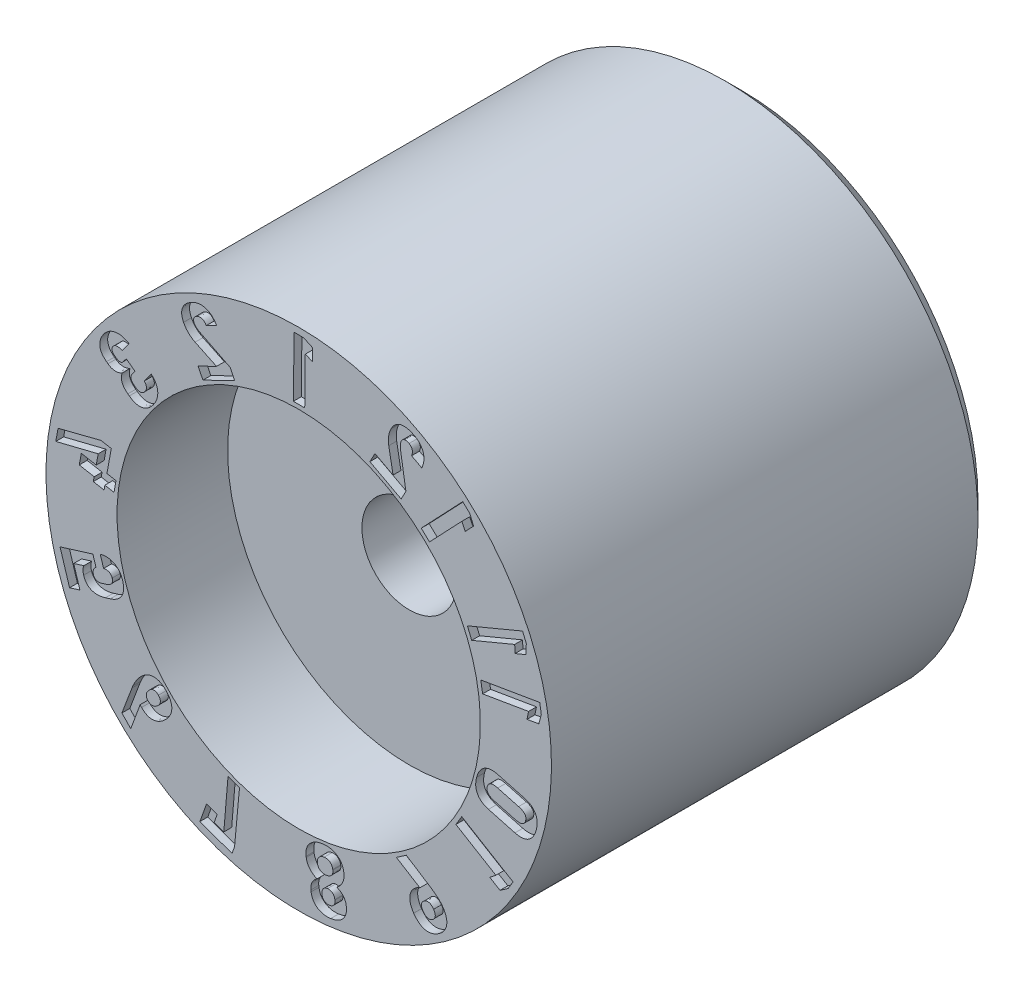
from build123d import *

# Parameters (mm, degrees)
CUT_EXTRUDE1_DEPTH = 0.25


with BuildPart() as part:
    # Sketch1 → Revolve1 (revolve)
    with BuildSketch(Plane.ZY, mode=Mode.PRIVATE) as revolve1_sk:
        Polygon((-14, -1.5), (-14, -7.5), (-13.5, -8), (0, -8), (0, -5.75), (-3.5, -5.75), (-3.5, -1.5), align=None)
    revolve(revolve1_sk.sketch.rotate(Axis((0, 0, 0), (0, 0, 1)), 180), axis=Axis((0, 0, 0), (0, 0, 1)))

    # Sketch2 → Cut-Extrude1 (cut)
    # profile 1 of 15: a face of its own
    with BuildSketch(Plane(origin=(0, 0, 0), x_dir=(0, -1, 0), z_dir=(0, 0, 1))):
        Polygon((-5.885153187, -0.168355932), (-5.881302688, 0.190394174), (-7.364876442, 0.206960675), (-7.274115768, 0.438182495), (-7.655787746, 0.442508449), (-7.787077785, 0.159422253), (-7.790397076, -0.146915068), align=None)
    # profile 2 of 15: a face of its own
    with BuildSketch(Plane(origin=(0, 0, 0), x_dir=(0, -1, 0), z_dir=(0, 0, 1))):
        with BuildLine():
            Line((-5.812942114, -2.167553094), (-6.295264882, -3.126022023))
            add(Edge.make_bspline(
                [(-6.295264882, -3.126022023), (-6.31520166, -3.166834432), (-6.346414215, -3.214181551), (-6.392438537, -3.261542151), (-6.421783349, -3.286652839), (-6.445317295, -3.302041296), (-6.461459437, -3.31016242)],
                knots=[0, 0, 0, 0, 0.540924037, 0.666718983, 0.785210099, 1, 1, 1, 1], degree=3))
            Line((-6.461459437, -3.31016242), (-6.464077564, -3.311132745))
            add(Edge.make_bspline(
                [(-6.464077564, -3.311132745), (-6.484746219, -3.321591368), (-6.517779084, -3.331425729), (-6.56228831, -3.329436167), (-6.593102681, -3.319655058), (-6.621650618, -3.302317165), (-6.659298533, -3.268966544), (-6.678882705, -3.234254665), (-6.691342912, -3.210282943)],
                knots=[0, 0, 0, 0, 0.246374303, 0.357484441, 0.468975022, 0.586096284, 0.710177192, 1, 1, 1, 1], degree=3))
            add(Edge.make_bspline(
                [(-6.691342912, -3.210282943), (-6.703164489, -3.186032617), (-6.715254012, -3.147124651), (-6.713467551, -3.093856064), (-6.702811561, -3.055802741), (-6.684911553, -3.019007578), (-6.648077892, -2.97095825), (-6.61063294, -2.942066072), (-6.583430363, -2.924510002)],
                knots=[0, 0, 0, 0, 0.239491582, 0.352314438, 0.467332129, 0.586809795, 0.712523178, 1, 1, 1, 1], degree=3))
            Line((-6.583430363, -2.924510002), (-6.582434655, -2.923797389))
            Line((-6.582434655, -2.923797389), (-6.743011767, -2.595286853))
            Line((-6.743011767, -2.595286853), (-6.744007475, -2.595999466))
            add(Edge.make_bspline(
                [(-6.744007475, -2.595999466), (-6.792261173, -2.623619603), (-6.859458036, -2.67046474), (-6.93484108, -2.74558773), (-6.980633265, -2.804634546), (-7.017421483, -2.866921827), (-7.044647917, -2.93211203), (-7.061866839, -2.99996788), (-7.06939807, -3.070051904), (-7.066888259, -3.141660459), (-7.051494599, -3.240720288), (-7.023404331, -3.312332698), (-7.001218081, -3.35902872)],
                knots=[0, 0, 0, 0, 0.185500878, 0.27133804, 0.354019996, 0.434024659, 0.511906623, 0.588797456, 0.666690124, 0.746155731, 0.827114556, 1, 1, 1, 1], degree=3))
            add(Edge.make_bspline(
                [(-7.001218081, -3.35902872), (-6.976993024, -3.408362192), (-6.936400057, -3.477857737), (-6.870052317, -3.557659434), (-6.818118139, -3.606210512), (-6.762975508, -3.645254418), (-6.705356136, -3.675823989), (-6.64412768, -3.69489597), (-6.580854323, -3.70550424), (-6.515312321, -3.705525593), (-6.423375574, -3.691574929), (-6.355871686, -3.667430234), (-6.312234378, -3.645743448)],
                knots=[0, 0, 0, 0, 0.194750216, 0.283308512, 0.36663251, 0.445697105, 0.521961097, 0.596530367, 0.671739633, 0.748345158, 0.827520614, 1, 1, 1, 1], degree=3))
            Line((-6.312234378, -3.645743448), (-6.311238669, -3.645030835))
            add(Edge.make_bspline(
                [(-6.311238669, -3.645030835), (-6.272379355, -3.62655984), (-6.217050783, -3.592404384), (-6.14845713, -3.538681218), (-6.100425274, -3.492926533), (-6.055421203, -3.444057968), (-6.002689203, -3.373963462), (-5.968114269, -3.318257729), (-5.949696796, -3.27877272)],
                knots=[0, 0, 0, 0, 0.245975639, 0.371149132, 0.498271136, 0.625429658, 0.751106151, 1, 1, 1, 1], degree=3))
            Line((-5.949696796, -3.27877272), (-5.625621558, -2.601596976))
            Line((-5.625621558, -2.601596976), (-5.341658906, -3.18329857))
            Line((-5.341658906, -3.18329857), (-5.032668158, -3.032475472))
            Line((-5.032668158, -3.032475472), (-5.52401196, -2.026569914))
            Line((-5.52401196, -2.026569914), (-5.812942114, -2.167553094))
        make_face()
    # profile 3 of 15: a face of its own
    with BuildSketch(Plane(origin=(0, 0, 0), x_dir=(0, -1, 0), z_dir=(0, 0, 1))):
        with BuildLine():
            Line((-4.376939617, -4.667268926), (-4.079887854, -4.889432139))
            add(Edge.make_bspline(
                [(-4.079887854, -4.889432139), (-4.066862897, -4.876079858), (-4.046076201, -4.858201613), (-4.015739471, -4.839389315), (-3.992796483, -4.829398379), (-3.969627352, -4.822369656), (-3.946235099, -4.818796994), (-3.922738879, -4.817817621), (-3.899154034, -4.820185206), (-3.875824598, -4.825871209), (-3.844475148, -4.838073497), (-3.822370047, -4.851262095), (-3.808438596, -4.861853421)],
                knots=[0, 0, 0, 0, 0.185321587, 0.271185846, 0.353768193, 0.433305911, 0.511128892, 0.588304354, 0.666454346, 0.745867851, 0.826198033, 1, 1, 1, 1], degree=3))
            add(Edge.make_bspline(
                [(-3.808438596, -4.861853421), (-3.783823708, -4.879930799), (-3.751641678, -4.911538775), (-3.72458046, -4.962732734), (-3.714814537, -5.002018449), (-3.713859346, -5.042510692), (-3.726562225, -5.099704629), (-3.749386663, -5.139214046), (-3.767887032, -5.164127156)],
                knots=[0, 0, 0, 0, 0.264915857, 0.382862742, 0.497043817, 0.612324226, 0.730419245, 1, 1, 1, 1], degree=3))
            Line((-3.767887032, -5.164127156), (-3.794423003, -5.199701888))
            add(Edge.make_bspline(
                [(-3.794423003, -5.199701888), (-3.814347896, -5.225103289), (-3.844811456, -5.261176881), (-3.894721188, -5.293181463), (-3.93038478, -5.308416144), (-3.966691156, -5.313923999), (-4.016197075, -5.310601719), (-4.049828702, -5.291494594), (-4.07010289, -5.276931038)],
                knots=[0, 0, 0, 0, 0.301107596, 0.428623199, 0.546089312, 0.65726331, 0.765523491, 1, 1, 1, 1], degree=3))
            Line((-4.07010289, -5.276931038), (-4.199209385, -5.180429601))
            Line((-4.199209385, -5.180429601), (-4.406597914, -5.457391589))
            Line((-4.406597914, -5.457391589), (-4.277491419, -5.553893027))
            add(Edge.make_bspline(
                [(-4.277491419, -5.553893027), (-4.260635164, -5.565909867), (-4.239461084, -5.589387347), (-4.225574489, -5.628128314), (-4.222703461, -5.659270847), (-4.2267163, -5.692307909), (-4.242889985, -5.740749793), (-4.263711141, -5.77512868), (-4.280687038, -5.79729185)],
                knots=[0, 0, 0, 0, 0.226456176, 0.333734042, 0.44465875, 0.565242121, 0.694773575, 1, 1, 1, 1], degree=3))
            Line((-4.280687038, -5.79729185), (-4.300088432, -5.823307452))
            add(Edge.make_bspline(
                [(-4.300088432, -5.823307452), (-4.316012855, -5.844002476), (-4.341474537, -5.8727942), (-4.383221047, -5.897670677), (-4.413897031, -5.908431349), (-4.445270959, -5.911701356), (-4.488564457, -5.906021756), (-4.518352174, -5.889751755), (-4.536312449, -5.876314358)],
                knots=[0, 0, 0, 0, 0.287243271, 0.411791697, 0.527494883, 0.639812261, 0.753406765, 1, 1, 1, 1], degree=3))
            add(Edge.make_bspline(
                [(-4.536312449, -5.876314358), (-4.548623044, -5.866683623), (-4.565926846, -5.850599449), (-4.582928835, -5.824364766), (-4.592820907, -5.80316774), (-4.599980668, -5.780443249), (-4.604201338, -5.756422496), (-4.605696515, -5.731072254), (-4.603721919, -5.704535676), (-4.599043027, -5.677018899), (-4.587890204, -5.638166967), (-4.576273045, -5.609270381), (-4.566471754, -5.590250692)],
                knots=[0, 0, 0, 0, 0.149750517, 0.222735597, 0.297357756, 0.372558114, 0.449624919, 0.529756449, 0.614461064, 0.703230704, 0.795895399, 1, 1, 1, 1], degree=3))
            Line((-4.566471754, -5.590250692), (-4.862435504, -5.368962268))
            add(Edge.make_bspline(
                [(-4.862435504, -5.368962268), (-4.891143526, -5.415961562), (-4.927755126, -5.488700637), (-4.957183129, -5.590589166), (-4.968838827, -5.664823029), (-4.971300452, -5.737836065), (-4.963491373, -5.808924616), (-4.946973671, -5.877593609), (-4.920574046, -5.943204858), (-4.886613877, -6.005640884), (-4.828255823, -6.083399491), (-4.774794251, -6.134163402), (-4.734803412, -6.163461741)],
                knots=[0, 0, 0, 0, 0.185347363, 0.2717601, 0.355594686, 0.437386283, 0.51661572, 0.595330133, 0.674074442, 0.753729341, 0.833596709, 1, 1, 1, 1], degree=3))
            add(Edge.make_bspline(
                [(-4.734803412, -6.163461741), (-4.702912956, -6.18745052), (-4.653871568, -6.219370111), (-4.585926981, -6.253329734), (-4.536705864, -6.272589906), (-4.487875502, -6.286144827), (-4.439468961, -6.294856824), (-4.391390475, -6.297394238), (-4.343961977, -6.295238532), (-4.297429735, -6.287633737), (-4.252425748, -6.273939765), (-4.20851339, -6.255839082), (-4.16645013, -6.231740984), (-4.125826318, -6.202455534), (-4.072028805, -6.155310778), (-4.036506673, -6.113185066), (-4.013813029, -6.083381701)],
                knots=[0, 0, 0, 0, 0.145014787, 0.212026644, 0.275758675, 0.336776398, 0.39593773, 0.454131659, 0.511359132, 0.568208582, 0.624972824, 0.681963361, 0.740474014, 0.800696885, 0.863706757, 1, 1, 1, 1], degree=3))
            Line((-4.013813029, -6.083381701), (-3.979267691, -6.037159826))
            add(Edge.make_bspline(
                [(-3.979267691, -6.037159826), (-3.954258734, -6.003922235), (-3.923173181, -5.949903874), (-3.900745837, -5.871615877), (-3.892935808, -5.8127359), (-3.894965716, -5.753416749), (-3.91096132, -5.673308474), (-3.936653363, -5.616438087), (-3.958795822, -5.580837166)],
                knots=[0, 0, 0, 0, 0.256338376, 0.378395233, 0.49923366, 0.620463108, 0.741960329, 1, 1, 1, 1], degree=3))
            add(Edge.make_bspline(
                [(-3.958795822, -5.580837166), (-3.938231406, -5.590570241), (-3.906080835, -5.601384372), (-3.862436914, -5.609970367), (-3.830187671, -5.613625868), (-3.797970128, -5.61297914), (-3.76571684, -5.609847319), (-3.733506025, -5.603287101), (-3.690475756, -5.590260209), (-3.6377408, -5.565586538), (-3.554013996, -5.509770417), (-3.502430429, -5.450637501), (-3.469850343, -5.408716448)],
                knots=[0, 0, 0, 0, 0.120783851, 0.179432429, 0.236283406, 0.292935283, 0.350395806, 0.408362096, 0.467374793, 0.589076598, 0.716315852, 1, 1, 1, 1], degree=3))
            Line((-3.469850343, -5.408716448), (-3.435305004, -5.362494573))
            add(Edge.make_bspline(
                [(-3.435305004, -5.362494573), (-3.404878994, -5.320622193), (-3.363804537, -5.256178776), (-3.330008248, -5.163323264), (-3.315460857, -5.09594918), (-3.311629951, -5.029090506), (-3.317329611, -4.963061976), (-3.334419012, -4.898255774), (-3.361512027, -4.834913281), (-3.398593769, -4.773342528), (-3.464190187, -4.69259431), (-3.52403709, -4.638839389), (-3.568330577, -4.606237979)],
                knots=[0, 0, 0, 0, 0.178322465, 0.259913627, 0.338341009, 0.414266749, 0.489149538, 0.565076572, 0.643478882, 0.72510618, 0.811155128, 1, 1, 1, 1], degree=3))
            add(Edge.make_bspline(
                [(-3.568330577, -4.606237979), (-3.611870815, -4.572683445), (-3.681516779, -4.531388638), (-3.779048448, -4.4902578), (-3.851703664, -4.470482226), (-3.92421048, -4.46013516), (-3.995914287, -4.45977701), (-4.066537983, -4.469343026), (-4.135653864, -4.488593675), (-4.202273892, -4.518347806), (-4.288368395, -4.572153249), (-4.343460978, -4.627186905), (-4.376939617, -4.667268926)],
                knots=[0, 0, 0, 0, 0.181568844, 0.266779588, 0.349602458, 0.430041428, 0.508528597, 0.586128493, 0.665194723, 0.745151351, 0.826792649, 1, 1, 1, 1], degree=3))
        make_face()
    # profile 4 of 15: a face of its own
    with BuildSketch(Plane(origin=(0, 0, 0), x_dir=(0, -1, 0), z_dir=(0, 0, 1))):
        Polygon((-1.76735733, -6.255397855), (-1.422102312, -7.616930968), (-1.024163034, -7.68967026), (-1.356596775, -6.346481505), (-1.016176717, -6.408938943), (-1.102909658, -6.881648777), (-0.751106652, -6.946096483), (-0.664391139, -6.473481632), (-0.51825503, -6.500293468), (-0.455984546, -6.161617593), (-0.602249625, -6.134799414), (-0.549444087, -5.846999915), (-0.901247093, -5.78255221), (-0.954042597, -6.070297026), (-1.707973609, -5.932061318), align=None)
    # profile 5 of 15: a face of its own
    with BuildSketch(Plane(origin=(0, 0, 0), x_dir=(0, -1, 0), z_dir=(0, 0, 1))):
        with BuildLine():
            Line((1.359546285, -6.280928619), (1.359944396, -6.282086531))
            Line((1.359944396, -6.282086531), (1.700787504, -6.176422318))
            Line((1.700787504, -6.176422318), (1.700389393, -6.175264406))
            add(Edge.make_bspline(
                [(1.700389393, -6.175264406), (1.693579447, -6.144174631), (1.689693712, -6.098094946), (1.697964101, -6.039231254), (1.711720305, -6.001184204), (1.731788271, -5.967675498), (1.768629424, -5.930397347), (1.803979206, -5.911794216), (1.829573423, -5.904389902)],
                knots=[0, 0, 0, 0, 0.286250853, 0.411970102, 0.532178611, 0.648041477, 0.760756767, 1, 1, 1, 1], degree=3))
            add(Edge.make_bspline(
                [(1.829573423, -5.904389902), (1.856561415, -5.895861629), (1.898483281, -5.889871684), (1.951960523, -5.901397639), (1.987345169, -5.919355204), (2.018894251, -5.945636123), (2.05801014, -5.993327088), (2.07622697, -6.038499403), (2.08646443, -6.070104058)],
                knots=[0, 0, 0, 0, 0.245943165, 0.357035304, 0.469046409, 0.5862071, 0.710396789, 1, 1, 1, 1], degree=3))
            Line((2.08646443, -6.070104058), (2.133351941, -6.221917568))
            add(Edge.make_bspline(
                [(2.133351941, -6.221917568), (2.143225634, -6.253640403), (2.153630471, -6.300650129), (2.151231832, -6.361526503), (2.141729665, -6.400101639), (2.125520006, -6.433924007), (2.092757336, -6.471736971), (2.058860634, -6.489686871), (2.034563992, -6.496843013)],
                knots=[0, 0, 0, 0, 0.302868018, 0.431900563, 0.550442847, 0.661671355, 0.769583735, 1, 1, 1, 1], degree=3))
            add(Edge.make_bspline(
                [(2.034563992, -6.496843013), (2.011738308, -6.503702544), (1.976667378, -6.510372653), (1.930327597, -6.50677804), (1.897834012, -6.498959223), (1.867479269, -6.48566651), (1.829851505, -6.460848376), (1.806583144, -6.435439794), (1.793961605, -6.416163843)],
                knots=[0, 0, 0, 0, 0.262338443, 0.385717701, 0.507592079, 0.627408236, 0.747450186, 1, 1, 1, 1], degree=3))
            Line((1.793961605, -6.416163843), (1.475589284, -6.514879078))
            Line((1.475589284, -6.514879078), (1.797775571, -7.55439719))
            Line((1.797775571, -7.55439719), (2.769266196, -7.253528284))
            Line((2.769266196, -7.253528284), (2.667438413, -6.925349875))
            Line((2.667438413, -6.925349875), (2.036790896, -7.120554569))
            Line((2.036790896, -7.120554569), (1.937985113, -6.800789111))
            add(Edge.make_bspline(
                [(1.937985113, -6.800789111), (1.955713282, -6.809342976), (1.984803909, -6.819486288), (2.026765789, -6.825786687), (2.061517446, -6.828033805), (2.09732674, -6.826772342), (2.14426206, -6.822854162), (2.178466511, -6.814845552), (2.200511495, -6.808155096)],
                knots=[0, 0, 0, 0, 0.220181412, 0.341690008, 0.473687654, 0.609113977, 0.742086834, 1, 1, 1, 1], degree=3))
            add(Edge.make_bspline(
                [(2.200511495, -6.808155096), (2.244247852, -6.794374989), (2.306968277, -6.767857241), (2.377960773, -6.715006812), (2.422080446, -6.669956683), (2.458624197, -6.619024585), (2.486500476, -6.561962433), (2.505749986, -6.499324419), (2.516539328, -6.431350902), (2.51858853, -6.358654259), (2.510978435, -6.251834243), (2.490949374, -6.171060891), (2.474430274, -6.116560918)],
                knots=[0, 0, 0, 0, 0.163580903, 0.239382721, 0.313637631, 0.38716286, 0.461531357, 0.538642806, 0.619556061, 0.7057246, 0.796949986, 1, 1, 1, 1], degree=3))
            Line((2.474430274, -6.116560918), (2.427542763, -5.964747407))
            add(Edge.make_bspline(
                [(2.427542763, -5.964747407), (2.410678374, -5.91030167), (2.379525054, -5.832622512), (2.321591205, -5.741248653), (2.273497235, -5.683906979), (2.220154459, -5.635664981), (2.16174598, -5.597010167), (2.09817238, -5.568523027), (2.030155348, -5.549471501), (1.957838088, -5.540601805), (1.853379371, -5.542353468), (1.77442819, -5.559292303), (1.722010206, -5.575723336)],
                knots=[0, 0, 0, 0, 0.186924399, 0.27222488, 0.353505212, 0.431383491, 0.507078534, 0.582001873, 0.658710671, 0.737652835, 0.819859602, 1, 1, 1, 1], degree=3))
            add(Edge.make_bspline(
                [(1.722010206, -5.575723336), (1.6757503, -5.590341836), (1.60883614, -5.618537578), (1.530317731, -5.672587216), (1.478742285, -5.719395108), (1.434167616, -5.772223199), (1.398045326, -5.831426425), (1.368937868, -5.895551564), (1.349138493, -5.965384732), (1.337991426, -6.03951741), (1.335095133, -6.145942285), (1.346922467, -6.226906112), (1.359546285, -6.280928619)],
                knots=[0, 0, 0, 0, 0.164951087, 0.244386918, 0.322686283, 0.400848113, 0.478265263, 0.557501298, 0.639295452, 0.72392502, 0.811482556, 1, 1, 1, 1], degree=3))
        make_face()
    # profile 6 of 15: a face of its own
    with BuildSketch(Plane(origin=(0, 0, 0), x_dir=(0, -1, 0), z_dir=(0, 0, 1))):
        with BuildLine():
            Line((4.067218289, -4.98997069), (4.068008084, -4.99072939))
            add(Edge.make_bspline(
                [(4.068008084, -4.99072939), (4.092620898, -5.016115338), (4.132644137, -5.052429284), (4.190426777, -5.097553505), (4.288009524, -5.165232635), (4.376535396, -5.212851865), (4.45033736, -5.245627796)],
                knots=[0, 0, 0, 0, 0.229425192, 0.35033143, 0.475684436, 1, 1, 1, 1], degree=3))
            add(Edge.make_bspline(
                [(4.45033736, -5.245627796), (4.463440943, -5.251114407), (4.488782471, -5.26304774), (4.515058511, -5.272766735), (4.528043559, -5.277373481)],
                knots=[0, 0, 0, 0, 0.507578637, 1, 1, 1, 1], degree=3))
            Line((4.528043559, -5.277373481), (5.373309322, -5.596946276))
            Line((5.373309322, -5.596946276), (5.663931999, -5.315754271))
            Line((5.663931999, -5.315754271), (4.854541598, -5.018208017))
            add(Edge.make_bspline(
                [(4.854541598, -5.018208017), (4.874059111, -5.005574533), (4.892156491, -4.99075352), (4.908856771, -4.974619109)],
                knots=[0.758085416, 0.758085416, 0.758085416, 0.758085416, 1, 1, 1, 1], degree=3))
            add(Edge.make_bspline(
                [(4.908856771, -4.974619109), (4.94424021, -4.940942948), (4.989834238, -4.885600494), (5.034658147, -4.803794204), (5.056175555, -4.741656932), (5.068587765, -4.678140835), (5.06967197, -4.61349998), (5.061328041, -4.548147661), (5.042543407, -4.482398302), (5.014154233, -4.416433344), (4.961717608, -4.325749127), (4.909184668, -4.263774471), (4.870927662, -4.223670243)],
                knots=[0, 0, 0, 0, 0.171552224, 0.250175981, 0.326701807, 0.401808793, 0.476742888, 0.552955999, 0.6326332, 0.716300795, 0.804840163, 1, 1, 1, 1], degree=3))
            Line((4.870927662, -4.223670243), (4.869742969, -4.222532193))
            add(Edge.make_bspline(
                [(4.869742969, -4.222532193), (4.830746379, -4.181078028), (4.767444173, -4.127074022), (4.675254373, -4.071239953), (4.606572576, -4.041902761), (4.537407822, -4.022738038), (4.467893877, -4.014734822), (4.39850819, -4.017035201), (4.329534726, -4.031363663), (4.261448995, -4.055770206), (4.169377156, -4.1042583), (4.10692275, -4.154944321), (4.067479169, -4.19294318)],
                knots=[0, 0, 0, 0, 0.186949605, 0.27196259, 0.353438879, 0.431722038, 0.507097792, 0.582641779, 0.658968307, 0.737737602, 0.819719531, 1, 1, 1, 1], degree=3))
            add(Edge.make_bspline(
                [(4.067479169, -4.19294318), (4.028364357, -4.230837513), (3.976043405, -4.291257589), (3.924047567, -4.380877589), (3.897374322, -4.447999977), (3.880913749, -4.516142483), (3.875694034, -4.585011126), (3.881083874, -4.654094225), (3.896997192, -4.723355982), (3.92395464, -4.792059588), (3.975706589, -4.885467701), (4.027778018, -4.949636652), (4.067218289, -4.98997069)],
                knots=[0, 0, 0, 0, 0.180435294, 0.262660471, 0.34194499, 0.418744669, 0.493877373, 0.569633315, 0.647321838, 0.728297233, 0.813160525, 1, 1, 1, 1], degree=3))
        make_face()
        with BuildLine():
            Line((4.597125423, -4.455339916), (4.598310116, -4.456477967))
            add(Edge.make_bspline(
                [(4.598310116, -4.456477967), (4.622350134, -4.481584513), (4.654454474, -4.520775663), (4.679315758, -4.579804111), (4.6879526, -4.621140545), (4.686927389, -4.66165505), (4.672045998, -4.715332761), (4.645542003, -4.749564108), (4.6251244, -4.769636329)],
                knots=[0, 0, 0, 0, 0.294172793, 0.419084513, 0.536108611, 0.647083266, 0.757101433, 1, 1, 1, 1], degree=3))
            add(Edge.make_bspline(
                [(4.6251244, -4.769636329), (4.604705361, -4.789103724), (4.569653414, -4.814154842), (4.515518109, -4.82644603), (4.474628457, -4.8260993), (4.433355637, -4.815479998), (4.375334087, -4.788184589), (4.337405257, -4.754694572), (4.312959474, -4.730205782)],
                knots=[0, 0, 0, 0, 0.239606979, 0.350713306, 0.462757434, 0.580918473, 0.706867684, 1, 1, 1, 1], degree=3))
            Line((4.312959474, -4.730205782), (4.312169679, -4.729447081))
            add(Edge.make_bspline(
                [(4.312169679, -4.729447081), (4.291646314, -4.707328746), (4.263538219, -4.672645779), (4.244101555, -4.619425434), (4.238684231, -4.581286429), (4.24282821, -4.543523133), (4.260608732, -4.492826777), (4.286847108, -4.460096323), (4.307144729, -4.440637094)],
                knots=[0, 0, 0, 0, 0.277690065, 0.398448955, 0.513505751, 0.626362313, 0.741961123, 1, 1, 1, 1], degree=3))
            add(Edge.make_bspline(
                [(4.307144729, -4.440637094), (4.327308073, -4.420334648), (4.361550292, -4.395798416), (4.413213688, -4.37923391), (4.451301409, -4.377076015), (4.489474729, -4.383566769), (4.542139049, -4.404676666), (4.575984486, -4.433825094), (4.597125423, -4.455339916)],
                knots=[0, 0, 0, 0, 0.260088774, 0.374782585, 0.488633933, 0.603177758, 0.72405985, 1, 1, 1, 1], degree=3))
        make_face(mode=Mode.SUBTRACT)
    # profile 7 of 15: a face of its own
    with BuildSketch(Plane(origin=(0, 0, 0), x_dir=(0, -1, 0), z_dir=(0, 0, 1))):
        Polygon((7.256514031, -2.031017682), (5.555129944, -1.873512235), (5.425210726, -2.237507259), (7.021597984, -2.371100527), (6.912220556, -2.677137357), (6.643941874, -2.581126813), (6.524146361, -2.916995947), (7.116019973, -3.128575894), (7.479650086, -2.110630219), align=None)
    # profile 8 of 15: a face of its own
    with BuildSketch(Plane(origin=(0, 0, 0), x_dir=(0, -1, 0), z_dir=(0, 0, 1))):
        with BuildLine():
            Line((6.383722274, 0.233674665), (6.414607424, 0.237614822))
            add(Edge.make_bspline(
                [(6.414607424, 0.237614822), (6.460996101, 0.242938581), (6.528596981, 0.263144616), (6.612468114, 0.30638441), (6.670550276, 0.348781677), (6.723236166, 0.397912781), (6.782117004, 0.472985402), (6.814999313, 0.536576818), (6.829495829, 0.581878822)],
                knots=[0, 0, 0, 0, 0.245873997, 0.369722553, 0.497260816, 0.624850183, 0.749381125, 1, 1, 1, 1], degree=3))
            add(Edge.make_bspline(
                [(6.829495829, 0.581878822), (6.851631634, 0.547950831), (6.891687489, 0.502065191), (6.955634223, 0.452881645), (7.007563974, 0.42284188), (7.06212033, 0.399847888), (7.136898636, 0.381524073), (7.194331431, 0.379417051), (7.23190499, 0.38501631)],
                knots=[0, 0, 0, 0, 0.257462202, 0.383888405, 0.51183656, 0.638238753, 0.759243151, 1, 1, 1, 1], degree=3))
            Line((7.23190499, 0.38501631), (7.281173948, 0.391272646))
            add(Edge.make_bspline(
                [(7.281173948, 0.391272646), (7.3279114, 0.396991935), (7.395492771, 0.414718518), (7.477774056, 0.455081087), (7.532214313, 0.493211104), (7.580046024, 0.538823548), (7.621266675, 0.590742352), (7.654444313, 0.649402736), (7.680561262, 0.713548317), (7.698886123, 0.782773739), (7.711498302, 0.883642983), (7.708804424, 0.961646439), (7.70150325, 1.014187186)],
                knots=[0, 0, 0, 0, 0.166920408, 0.24562204, 0.324151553, 0.401797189, 0.479414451, 0.5585348, 0.640110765, 0.724597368, 0.811872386, 1, 1, 1, 1], degree=3))
            add(Edge.make_bspline(
                [(7.70150325, 1.014187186), (7.693982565, 1.066446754), (7.678040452, 1.142992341), (7.63838367, 1.236532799), (7.603474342, 1.299088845), (7.561210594, 1.354025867), (7.514143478, 1.401908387), (7.461028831, 1.441255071), (7.403152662, 1.47274805), (7.340490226, 1.495108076), (7.25080929, 1.514088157), (7.180691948, 1.512435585), (7.134208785, 1.506358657)],
                knots=[0, 0, 0, 0, 0.187940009, 0.275344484, 0.360030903, 0.44165333, 0.520785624, 0.597734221, 0.675551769, 0.753950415, 0.833210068, 1, 1, 1, 1], degree=3))
            Line((7.134208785, 1.506358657), (7.084939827, 1.500102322))
            add(Edge.make_bspline(
                [(7.084939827, 1.500102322), (7.046799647, 1.495311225), (6.991084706, 1.478546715), (6.923065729, 1.440759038), (6.876602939, 1.403538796), (6.833946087, 1.360937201), (6.786089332, 1.295339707), (6.759581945, 1.240174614), (6.747764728, 1.201072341)],
                knots=[0, 0, 0, 0, 0.242029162, 0.363319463, 0.48911611, 0.616671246, 0.742842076, 1, 1, 1, 1], degree=3))
            add(Edge.make_bspline(
                [(6.747764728, 1.201072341), (6.720636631, 1.240396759), (6.673875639, 1.295883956), (6.595965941, 1.352162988), (6.532925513, 1.387357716), (6.465677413, 1.413079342), (6.374083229, 1.435794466), (6.303189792, 1.435441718), (6.257179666, 1.429918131)],
                knots=[0, 0, 0, 0, 0.252401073, 0.377133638, 0.504621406, 0.631738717, 0.755354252, 1, 1, 1, 1], degree=3))
            Line((6.257179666, 1.429918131), (6.226294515, 1.425977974))
            add(Edge.make_bspline(
                [(6.226294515, 1.425977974), (6.17677854, 1.419639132), (6.104992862, 1.401021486), (6.017674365, 1.358132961), (5.960475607, 1.317055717), (5.909395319, 1.269174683), (5.866513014, 1.213551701), (5.831051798, 1.151244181), (5.804115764, 1.08245928), (5.784892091, 1.008337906), (5.770768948, 0.900490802), (5.775355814, 0.816966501), (5.782272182, 0.760745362)],
                knots=[0, 0, 0, 0, 0.1662813, 0.245020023, 0.322996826, 0.400171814, 0.477620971, 0.556199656, 0.638392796, 0.723135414, 0.810891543, 1, 1, 1, 1], degree=3))
            add(Edge.make_bspline(
                [(5.782272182, 0.760745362), (5.789389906, 0.704510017), (5.807671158, 0.623006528), (5.849105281, 0.522447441), (5.886549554, 0.455691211), (5.930509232, 0.396348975), (5.980886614, 0.345493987), (6.036852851, 0.302844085), (6.098563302, 0.269491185), (6.164593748, 0.244892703), (6.259973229, 0.225874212), (6.334222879, 0.227215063), (6.383722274, 0.233674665)],
                knots=[0, 0, 0, 0, 0.188969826, 0.276571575, 0.361700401, 0.443462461, 0.52195862, 0.599529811, 0.677129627, 0.754933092, 0.833532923, 1, 1, 1, 1], degree=3))
        make_face()
        with BuildLine():
            Line((6.324801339, 1.078128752), (6.342697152, 1.080693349))
            add(Edge.make_bspline(
                [(6.342697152, 1.080693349), (6.36279953, 1.08399806), (6.39291409, 1.083408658), (6.43173524, 1.075943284), (6.458349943, 1.065421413), (6.483381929, 1.052126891), (6.505687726, 1.034434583), (6.526485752, 1.014233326), (6.544289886, 0.990161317), (6.559509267, 0.963254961), (6.576683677, 0.922775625), (6.583555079, 0.889629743), (6.586905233, 0.866973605)],
                knots=[0, 0, 0, 0, 0.16669051, 0.246112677, 0.323892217, 0.40126476, 0.478432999, 0.55727091, 0.639208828, 0.723761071, 0.811152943, 1, 1, 1, 1], degree=3))
            add(Edge.make_bspline(
                [(6.586905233, 0.866973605), (6.589820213, 0.844318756), (6.591437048, 0.810517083), (6.585669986, 0.766916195), (6.577904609, 0.73681742), (6.566517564, 0.709134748), (6.552212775, 0.683735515), (6.534443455, 0.661098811), (6.513582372, 0.641310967), (6.489996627, 0.624523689), (6.454436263, 0.60708053), (6.425316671, 0.599314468), (6.405202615, 0.596942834)],
                knots=[0, 0, 0, 0, 0.187429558, 0.275451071, 0.359683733, 0.441509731, 0.520154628, 0.597919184, 0.676478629, 0.755123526, 0.834279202, 1, 1, 1, 1], degree=3))
            Line((6.405202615, 0.596942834), (6.385594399, 0.594635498))
            add(Edge.make_bspline(
                [(6.385594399, 0.594635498), (6.363963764, 0.591054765), (6.331752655, 0.591449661), (6.289987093, 0.598124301), (6.261086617, 0.608048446), (6.234247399, 0.621866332), (6.209373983, 0.638570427), (6.187452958, 0.65926777), (6.168246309, 0.683157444), (6.152297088, 0.710346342), (6.133980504, 0.750396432), (6.126937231, 0.783490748), (6.123858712, 0.805910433)],
                knots=[0, 0, 0, 0, 0.17286694, 0.25386239, 0.334267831, 0.413835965, 0.492611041, 0.570906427, 0.651843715, 0.734729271, 0.820133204, 1, 1, 1, 1], degree=3))
            add(Edge.make_bspline(
                [(6.123858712, 0.805910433), (6.120503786, 0.828410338), (6.120076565, 0.862081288), (6.12689421, 0.905593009), (6.135877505, 0.935826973), (6.14813579, 0.964121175), (6.164666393, 0.989539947), (6.184347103, 1.01238777), (6.207225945, 1.032549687), (6.233065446, 1.049291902), (6.271257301, 1.068285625), (6.303243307, 1.074904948), (6.324801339, 1.078128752)],
                knots=[0, 0, 0, 0, 0.179137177, 0.263849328, 0.346610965, 0.427374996, 0.50626182, 0.584852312, 0.66468001, 0.74595602, 0.827180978, 1, 1, 1, 1], degree=3))
        make_face(mode=Mode.SUBTRACT)
        with BuildLine():
            Line((7.117138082, 1.143303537), (7.135402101, 1.145987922))
            add(Edge.make_bspline(
                [(7.135402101, 1.145987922), (7.154120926, 1.148094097), (7.182267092, 1.149667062), (7.218110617, 1.142370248), (7.243037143, 1.13496047), (7.266021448, 1.123754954), (7.286968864, 1.109795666), (7.305699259, 1.092634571), (7.322335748, 1.072919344), (7.336242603, 1.050268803), (7.35098947, 1.016059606), (7.357950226, 0.988347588), (7.360284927, 0.969141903)],
                knots=[0, 0, 0, 0, 0.176372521, 0.258700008, 0.339762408, 0.417993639, 0.495919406, 0.573463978, 0.65383693, 0.735485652, 0.820064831, 1, 1, 1, 1], degree=3))
            add(Edge.make_bspline(
                [(7.360284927, 0.969141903), (7.362978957, 0.950000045), (7.363588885, 0.921401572), (7.358067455, 0.884462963), (7.35027571, 0.859038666), (7.339687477, 0.835358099), (7.325501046, 0.814086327), (7.309072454, 0.794584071), (7.289198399, 0.778026), (7.267116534, 0.763892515), (7.233599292, 0.748723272), (7.206452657, 0.741499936), (7.187444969, 0.739454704)],
                knots=[0, 0, 0, 0, 0.178886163, 0.263391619, 0.345004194, 0.424566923, 0.502824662, 0.581173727, 0.660014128, 0.741521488, 0.823405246, 1, 1, 1, 1], degree=3))
            Line((7.187444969, 0.739454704), (7.16820496, 0.737267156))
            add(Edge.make_bspline(
                [(7.16820496, 0.737267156), (7.148534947, 0.734362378), (7.119301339, 0.733925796), (7.081399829, 0.739253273), (7.055275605, 0.747154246), (7.030776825, 0.758036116), (7.008252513, 0.77179522), (6.988359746, 0.788915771), (6.970770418, 0.808607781), (6.956208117, 0.831216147), (6.940161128, 0.865221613), (6.933093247, 0.893164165), (6.930820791, 0.912489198)],
                knots=[0, 0, 0, 0, 0.179228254, 0.262659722, 0.344810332, 0.424891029, 0.504315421, 0.582306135, 0.661155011, 0.742046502, 0.82433766, 1, 1, 1, 1], degree=3))
            add(Edge.make_bspline(
                [(6.930820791, 0.912489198), (6.928078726, 0.931649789), (6.927410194, 0.960384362), (6.934261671, 0.997235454), (6.943053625, 1.022542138), (6.954113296, 1.046532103), (6.969737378, 1.067647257), (6.987380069, 1.08733068), (7.008927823, 1.103707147), (7.032255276, 1.118544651), (7.068200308, 1.133670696), (7.096928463, 1.141218), (7.117138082, 1.143303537)],
                knots=[0, 0, 0, 0, 0.173858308, 0.255853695, 0.3354019, 0.414134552, 0.492060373, 0.570450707, 0.650797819, 0.734328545, 0.818212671, 1, 1, 1, 1], degree=3))
        make_face(mode=Mode.SUBTRACT)
    # profile 9 of 15: a face of its own
    with BuildSketch(Plane(origin=(0, 0, 0), x_dir=(0, -1, 0), z_dir=(0, 0, 1))):
        with BuildLine():
            Line((6.24184659, 3.638700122), (6.243307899, 3.639450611))
            add(Edge.make_bspline(
                [(6.243307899, 3.639450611), (6.290749, 3.671901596), (6.355592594, 3.725752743), (6.426494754, 3.808372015), (6.467578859, 3.871479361), (6.497668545, 3.937037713), (6.517592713, 4.004582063), (6.526161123, 4.073956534), (6.524349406, 4.144842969), (6.511046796, 4.216643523), (6.477962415, 4.316076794), (6.437907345, 4.386506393), (6.406914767, 4.432007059)],
                knots=[0, 0, 0, 0, 0.187469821, 0.273143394, 0.354214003, 0.43221498, 0.507589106, 0.582962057, 0.6592416, 0.7379537, 0.820209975, 1, 1, 1, 1], degree=3))
            add(Edge.make_bspline(
                [(6.406914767, 4.432007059), (6.376508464, 4.477809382), (6.323550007, 4.538225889), (6.243078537, 4.604789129), (6.179900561, 4.641520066), (6.11416663, 4.66896351), (6.045520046, 4.684359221), (5.974934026, 4.69054322), (5.902323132, 4.684642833), (5.828208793, 4.668878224), (5.724996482, 4.631513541), (5.651568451, 4.589011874), (5.603762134, 4.556315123)],
                knots=[0, 0, 0, 0, 0.178234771, 0.259637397, 0.338301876, 0.414869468, 0.490216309, 0.566018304, 0.644300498, 0.726036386, 0.81161072, 1, 1, 1, 1], degree=3))
            Line((5.603762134, 4.556315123), (5.602300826, 4.555564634))
            add(Edge.make_bspline(
                [(5.602300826, 4.555564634), (5.575139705, 4.536248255), (5.534893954, 4.504609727), (5.484919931, 4.456093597), (5.446905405, 4.415188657), (5.409108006, 4.370338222), (5.356771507, 4.304329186), (5.319021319, 4.251777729), (5.294091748, 4.215372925)],
                knots=[0, 0, 0, 0, 0.216736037, 0.331977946, 0.452460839, 0.579604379, 0.71315568, 1, 1, 1, 1], degree=3))
            add(Edge.make_bspline(
                [(5.294091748, 4.215372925), (5.286972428, 4.204409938), (5.27178557, 4.183416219), (5.257615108, 4.161717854), (5.25095223, 4.150742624)],
                knots=[0, 0, 0, 0, 0.504424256, 1, 1, 1, 1], degree=3))
            Line((5.25095223, 4.150742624), (4.77128473, 3.404855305))
            Line((4.77128473, 3.404855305), (4.987367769, 3.091387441))
            Line((4.987367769, 3.091387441), (5.448228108, 3.835268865))
            add(Edge.make_bspline(
                [(5.448228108, 3.835268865), (5.448794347, 3.833422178), (5.453279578, 3.819230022), (5.468888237, 3.778838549), (5.490240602, 3.74319131), (5.506141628, 3.719776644)],
                knots=[0.562907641, 0.562907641, 0.562907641, 0.562907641, 0.582426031, 0.71330413, 1, 1, 1, 1], degree=3))
            add(Edge.make_bspline(
                [(5.506141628, 3.719776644), (5.532177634, 3.682306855), (5.576957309, 3.63092644), (5.649313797, 3.578526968), (5.70720601, 3.549055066), (5.768408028, 3.528123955), (5.832421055, 3.516112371), (5.898955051, 3.513936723), (5.967362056, 3.52050552), (6.036741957, 3.536212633), (6.131635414, 3.570198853), (6.198442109, 3.609360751), (6.24184659, 3.638700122)],
                knots=[0, 0, 0, 0, 0.164733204, 0.243043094, 0.320867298, 0.398148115, 0.475570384, 0.554853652, 0.637425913, 0.722764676, 0.810743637, 1, 1, 1, 1], degree=3))
        make_face()
        with BuildLine():
            Line((5.820791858, 4.268572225), (5.821884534, 4.269441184))
            add(Edge.make_bspline(
                [(5.821884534, 4.269441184), (5.848164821, 4.287921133), (5.889585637, 4.309578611), (5.947724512, 4.322884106), (5.988000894, 4.322463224), (6.025968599, 4.313237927), (6.074465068, 4.288242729), (6.103175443, 4.257113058), (6.119091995, 4.233711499)],
                knots=[0, 0, 0, 0, 0.2836562, 0.407176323, 0.522864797, 0.635948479, 0.749089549, 1, 1, 1, 1], degree=3))
            add(Edge.make_bspline(
                [(6.119091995, 4.233711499), (6.135714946, 4.210027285), (6.154554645, 4.17148358), (6.161193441, 4.116606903), (6.155904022, 4.077524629), (6.141610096, 4.03972044), (6.108526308, 3.989849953), (6.073409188, 3.95886892), (6.046578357, 3.941004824)],
                knots=[0, 0, 0, 0, 0.25396243, 0.366761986, 0.479368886, 0.595910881, 0.717631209, 1, 1, 1, 1], degree=3))
            Line((6.046578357, 3.941004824), (6.045485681, 3.940135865))
            add(Edge.make_bspline(
                [(6.045485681, 3.940135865), (6.017734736, 3.922321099), (5.976032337, 3.897173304), (5.915887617, 3.884511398), (5.874761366, 3.883605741), (5.835724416, 3.892415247), (5.785948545, 3.917215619), (5.756558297, 3.948902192), (5.740352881, 3.97271868)],
                knots=[0, 0, 0, 0, 0.286687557, 0.409653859, 0.525636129, 0.638334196, 0.750719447, 1, 1, 1, 1], degree=3))
            add(Edge.make_bspline(
                [(5.740352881, 3.97271868), (5.724322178, 3.996031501), (5.705315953, 4.034328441), (5.700533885, 4.089235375), (5.706668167, 4.128689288), (5.722277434, 4.166856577), (5.755654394, 4.218747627), (5.794033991, 4.24909324), (5.820791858, 4.268572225)],
                knots=[0, 0, 0, 0, 0.245772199, 0.358139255, 0.470980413, 0.587123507, 0.711724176, 1, 1, 1, 1], degree=3))
        make_face(mode=Mode.SUBTRACT)
    # profile 10 of 15: a face of its own
    with BuildSketch(Plane(origin=(0, 0, 0), x_dir=(0, -1, 0), z_dir=(0, 0, 1))):
        Polygon((2.835416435, 5.159749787), (3.141680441, 4.975597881), (3.902263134, 6.239790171), (4.054716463, 6.045817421), (4.250124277, 6.37098681), (4.073807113, 6.626027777), (3.812451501, 6.78333898), align=None)
    # profile 11 of 15: a face of its own
    with BuildSketch(Plane(origin=(0, 0, 0), x_dir=(0, -1, 0), z_dir=(0, 0, 1))):
        with BuildLine():
            Line((2.212407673, 6.006400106), (2.43863833, 6.843654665))
            add(Edge.make_bspline(
                [(2.43863833, 6.843654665), (2.44910096, 6.88283367), (2.460420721, 6.941296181), (2.466160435, 7.018686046), (2.463910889, 7.073096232), (2.456526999, 7.125152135), (2.444274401, 7.175020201), (2.425992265, 7.222505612), (2.402714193, 7.267779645), (2.373738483, 7.310039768), (2.339897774, 7.34946275), (2.301048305, 7.385715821), (2.256309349, 7.417875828), (2.207155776, 7.447750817), (2.132103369, 7.483467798), (2.071556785, 7.504266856), (2.029297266, 7.515493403)],
                knots=[0, 0, 0, 0, 0.135733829, 0.198831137, 0.259399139, 0.31767141, 0.37462448, 0.430931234, 0.487646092, 0.544689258, 0.602065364, 0.661305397, 0.722119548, 0.786221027, 0.853655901, 1, 1, 1, 1], degree=3))
            add(Edge.make_bspline(
                [(2.029297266, 7.515493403), (1.986944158, 7.527014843), (1.924060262, 7.540223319), (1.841089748, 7.547123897), (1.783511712, 7.546692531), (1.728735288, 7.540905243), (1.676916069, 7.529327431), (1.627572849, 7.51342455), (1.581622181, 7.490916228), (1.538841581, 7.463621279), (1.499107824, 7.431904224), (1.46315664, 7.395121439), (1.430927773, 7.353390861), (1.402022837, 7.307161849), (1.36684366, 7.23765256), (1.347852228, 7.180816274), (1.33691724, 7.141546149)],
                knots=[0, 0, 0, 0, 0.146794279, 0.214109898, 0.27799967, 0.339036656, 0.397877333, 0.455243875, 0.511944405, 0.568412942, 0.624625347, 0.681540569, 0.739936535, 0.800569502, 0.863571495, 1, 1, 1, 1], degree=3))
            Line((1.33691724, 7.141546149), (1.110686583, 6.30429159))
            add(Edge.make_bspline(
                [(1.110686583, 6.30429159), (1.100223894, 6.265112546), (1.088904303, 6.206650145), (1.083164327, 6.129260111), (1.085414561, 6.074850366), (1.092796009, 6.0227929), (1.105057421, 5.972930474), (1.123307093, 5.925424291), (1.146735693, 5.880173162), (1.175295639, 5.837572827), (1.209147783, 5.79806256), (1.248570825, 5.762302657), (1.292856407, 5.729576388), (1.342138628, 5.699844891), (1.416982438, 5.663957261), (1.477910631, 5.644074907), (1.520027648, 5.632452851)],
                knots=[0, 0, 0, 0, 0.135706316, 0.198790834, 0.259346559, 0.317607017, 0.374548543, 0.430843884, 0.487547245, 0.544786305, 0.602150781, 0.66126366, 0.722560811, 0.786218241, 0.853639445, 1, 1, 1, 1], degree=3))
            add(Edge.make_bspline(
                [(1.520027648, 5.632452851), (1.562359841, 5.620480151), (1.625424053, 5.608331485), (1.708471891, 5.600994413), (1.76610086, 5.602099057), (1.82094885, 5.607568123), (1.872752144, 5.619783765), (1.921906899, 5.636753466), (1.968092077, 5.659429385), (2.010938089, 5.686957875), (2.050535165, 5.719138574), (2.086300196, 5.756026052), (2.118944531, 5.797282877), (2.14806678, 5.842843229), (2.182490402, 5.911718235), (2.202228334, 5.96740033), (2.212407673, 6.006400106)],
                knots=[0, 0, 0, 0, 0.147190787, 0.214626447, 0.278832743, 0.339978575, 0.398870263, 0.456661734, 0.513809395, 0.570752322, 0.626890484, 0.684320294, 0.742477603, 0.802826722, 0.865076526, 1, 1, 1, 1], degree=3))
        make_face()
        with BuildLine():
            Line((1.481739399, 6.299271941), (1.660182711, 6.959061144))
            add(Edge.make_bspline(
                [(1.660182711, 6.959061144), (1.671147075, 6.99868426), (1.690817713, 7.05438125), (1.730430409, 7.117314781), (1.758029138, 7.146998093), (1.782291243, 7.165076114), (1.801209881, 7.175928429), (1.821662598, 7.1834617), (1.842995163, 7.188584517), (1.865473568, 7.191136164), (1.897833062, 7.190632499), (1.922390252, 7.18597057), (1.938815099, 7.181457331)],
                knots=[0, 0, 0, 0, 0.304408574, 0.431797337, 0.547028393, 0.601171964, 0.654843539, 0.707489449, 0.761565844, 0.816558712, 0.874111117, 1, 1, 1, 1], degree=3))
            add(Edge.make_bspline(
                [(1.938815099, 7.181457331), (1.955054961, 7.1765368), (1.978982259, 7.169010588), (2.006906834, 7.15245555), (2.025335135, 7.139319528), (2.041330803, 7.124137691), (2.054461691, 7.106924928), (2.066230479, 7.088526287), (2.077531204, 7.060277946), (2.086863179, 7.020742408), (2.089417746, 6.946267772), (2.079300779, 6.888127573), (2.067929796, 6.848497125)],
                knots=[0, 0, 0, 0, 0.125752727, 0.182944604, 0.238821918, 0.292439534, 0.344834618, 0.39822355, 0.4529537, 0.568398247, 0.695928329, 1, 1, 1, 1], degree=3))
            Line((2.067929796, 6.848497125), (1.889486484, 6.188707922))
            add(Edge.make_bspline(
                [(1.889486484, 6.188707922), (1.87833576, 6.149188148), (1.859201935, 6.093324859), (1.818977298, 6.030821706), (1.79112798, 6.001520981), (1.766870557, 5.983392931), (1.747952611, 5.97251305), (1.72756471, 5.965141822), (1.706336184, 5.95950207), (1.683776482, 5.957442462), (1.651336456, 5.957751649), (1.626761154, 5.962542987), (1.610342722, 5.967010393)],
                knots=[0, 0, 0, 0, 0.30456185, 0.431162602, 0.546723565, 0.600894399, 0.654592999, 0.707265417, 0.760649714, 0.816466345, 0.874047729, 1, 1, 1, 1], degree=3))
            add(Edge.make_bspline(
                [(1.610342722, 5.967010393), (1.594098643, 5.97192377), (1.570183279, 5.97947023), (1.542350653, 5.995929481), (1.524064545, 6.009058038), (1.508151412, 6.024281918), (1.49472105, 6.041283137), (1.483291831, 6.059910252), (1.472013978, 6.087903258), (1.462263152, 6.127217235), (1.46070852, 6.2015958), (1.470101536, 6.259623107), (1.481739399, 6.299271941)],
                knots=[0, 0, 0, 0, 0.126014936, 0.183326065, 0.238377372, 0.292106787, 0.345479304, 0.39816533, 0.453009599, 0.56797277, 0.695294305, 1, 1, 1, 1], degree=3))
        make_face(mode=Mode.SUBTRACT)
    # profile 12 of 15: a face of its own
    with BuildSketch(Plane(origin=(0, 0, 0), x_dir=(0, -1, 0), z_dir=(0, 0, 1))):
        Polygon((-1.211502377, 5.761341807), (-0.859484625, 5.821176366), (-1.10584996, 7.274061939), (-0.86439821, 7.226783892), (-0.927844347, 7.599913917), (-1.227850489, 7.678888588), (-1.528162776, 7.627643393), align=None)
    # profile 13 of 15: a face of its own
    with BuildSketch(Plane(origin=(0, 0, 0), x_dir=(0, -1, 0), z_dir=(0, 0, 1))):
        Polygon((-2.483347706, 5.33832116), (-2.154422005, 5.476015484), (-2.722935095, 6.836471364), (-2.476306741, 6.84477118), (-2.622627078, 7.194304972), (-2.932801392, 7.203085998), (-3.213823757, 7.085508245), align=None)
    # profile 14 of 15: a face of its own
    with BuildSketch(Plane(origin=(0, 0, 0), x_dir=(0, -1, 0), z_dir=(0, 0, 1))):
        Polygon((-4.430620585, 3.87782594), (-4.182931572, 4.138837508), (-5.260687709, 5.162177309), (-5.036906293, 5.270536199), (-5.31411265, 5.533398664), (-5.603568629, 5.415029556), (-5.815107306, 5.192245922), align=None)
    # profile 15 of 15: a face of its own
    with BuildSketch(Plane(origin=(0, 0, 0), x_dir=(0, -1, 0), z_dir=(0, 0, 1))):
        with BuildLine():
            Line((-5.196551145, 3.392641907), (-6.257309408, 3.220825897))
            add(Edge.make_bspline(
                [(-6.257309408, 3.220825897), (-6.302163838, 3.213750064), (-6.358957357, 3.210151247), (-6.424216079, 3.220025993), (-6.461945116, 3.228655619), (-6.488218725, 3.239204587), (-6.50451492, 3.247465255)],
                knots=[0, 0, 0, 0, 0.541086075, 0.665754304, 0.782974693, 1, 1, 1, 1], degree=3))
            Line((-6.50451492, 3.247465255), (-6.506797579, 3.248704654))
            add(Edge.make_bspline(
                [(-6.506797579, 3.248704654), (-6.527135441, 3.259583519), (-6.554829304, 3.28030551), (-6.579353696, 3.317677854), (-6.589450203, 3.34847618), (-6.592309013, 3.381694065), (-6.586774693, 3.431567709), (-6.571669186, 3.468157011), (-6.558702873, 3.49205546)],
                knots=[0, 0, 0, 0, 0.245873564, 0.358403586, 0.469926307, 0.586616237, 0.710080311, 1, 1, 1, 1], degree=3))
            add(Edge.make_bspline(
                [(-6.558702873, 3.49205546), (-6.545857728, 3.516090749), (-6.521333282, 3.549001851), (-6.476888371, 3.578758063), (-6.440058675, 3.592881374), (-6.399509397, 3.599244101), (-6.338949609, 3.598130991), (-6.293324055, 3.584749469), (-6.26323756, 3.572806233)],
                knots=[0, 0, 0, 0, 0.241468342, 0.353131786, 0.468071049, 0.586792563, 0.713262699, 1, 1, 1, 1], degree=3))
            Line((-6.26323756, 3.572806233), (-6.262254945, 3.572075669))
            Line((-6.262254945, 3.572075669), (-6.089782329, 3.895169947))
            Line((-6.089782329, 3.895169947), (-6.090764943, 3.895900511))
            add(Edge.make_bspline(
                [(-6.090764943, 3.895900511), (-6.141625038, 3.918870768), (-6.219172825, 3.946146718), (-6.324637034, 3.963418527), (-6.399545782, 3.965471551), (-6.471753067, 3.958552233), (-6.540672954, 3.942490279), (-6.605917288, 3.91646581), (-6.667040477, 3.881255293), (-6.723602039, 3.837222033), (-6.794472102, 3.766386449), (-6.836585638, 3.702080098), (-6.860996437, 3.656386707)],
                knots=[0, 0, 0, 0, 0.185825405, 0.271798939, 0.354705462, 0.434521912, 0.512614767, 0.589405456, 0.667459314, 0.746593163, 0.827316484, 1, 1, 1, 1], degree=3))
            add(Edge.make_bspline(
                [(-6.860996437, 3.656386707), (-6.887061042, 3.607947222), (-6.919298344, 3.534186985), (-6.944826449, 3.433482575), (-6.954103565, 3.362766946), (-6.953421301, 3.29484405), (-6.94324037, 3.230315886), (-6.924273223, 3.16901818), (-6.894875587, 3.111812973), (-6.856778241, 3.058482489), (-6.791423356, 2.992152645), (-6.732068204, 2.95192029), (-6.688909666, 2.929267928)],
                knots=[0, 0, 0, 0, 0.194591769, 0.282898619, 0.366579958, 0.446068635, 0.52219696, 0.596816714, 0.671938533, 0.748610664, 0.827685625, 1, 1, 1, 1], degree=3))
            Line((-6.688909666, 2.929267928), (-6.687609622, 2.928759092))
            add(Edge.make_bspline(
                [(-6.687609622, 2.928759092), (-6.649523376, 2.908737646), (-6.5899022, 2.882620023), (-6.505863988, 2.859468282), (-6.440715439, 2.846758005), (-6.374483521, 2.839319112), (-6.286568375, 2.837410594), (-6.221045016, 2.842476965), (-6.178156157, 2.850564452)],
                knots=[0, 0, 0, 0, 0.246134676, 0.37037894, 0.497711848, 0.625301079, 0.750898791, 1, 1, 1, 1], degree=3))
            Line((-6.178156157, 2.850564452), (-5.438735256, 2.985430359))
            Line((-5.438735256, 2.985430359), (-5.743510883, 2.413586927))
            Line((-5.743510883, 2.413586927), (-5.439660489, 2.251760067))
            Line((-5.439660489, 2.251760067), (-4.912262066, 3.241239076))
            Line((-4.912262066, 3.241239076), (-5.196551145, 3.392641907))
        make_face()
    extrude(amount=-CUT_EXTRUDE1_DEPTH, mode=Mode.SUBTRACT)


solid = part.part
